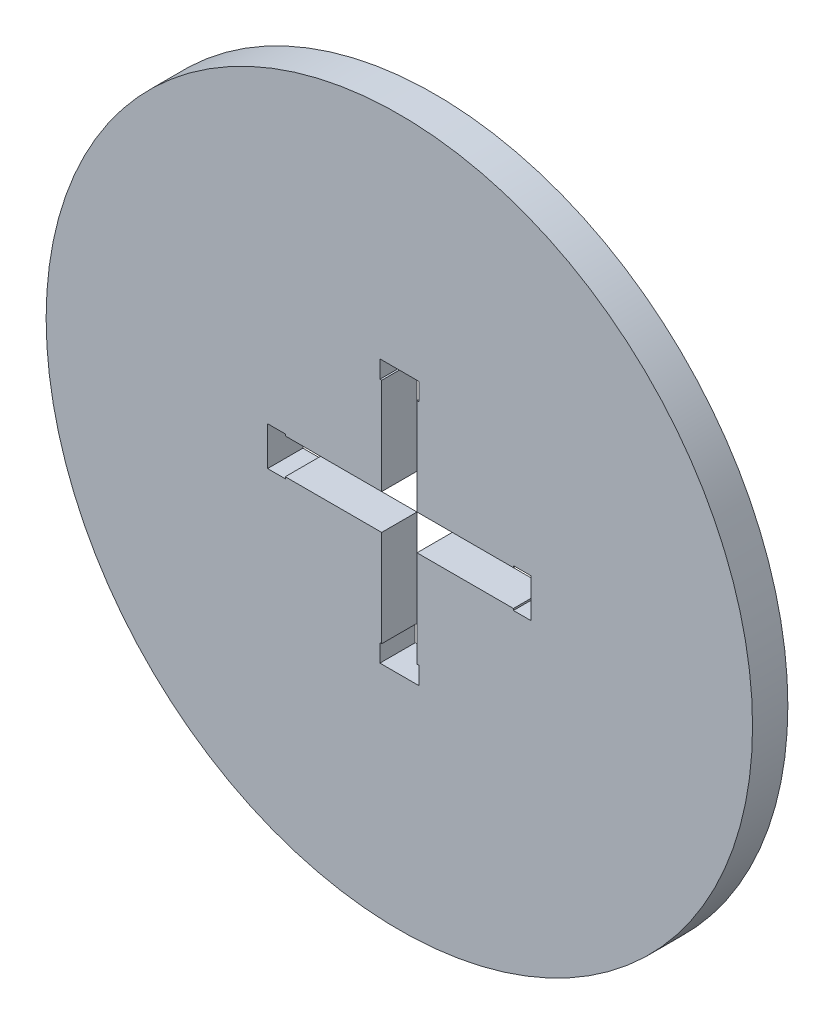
from build123d import *

# Parameters (mm, degrees)
CROQUIS2_R                  = 127
SALIENTE_EXTRUIR1_DEPTH     = 12.7
CORTAR_EXTRUIR1_DEPTH       = 181.05357536
CROQUIS4_W                  = 0.635
CROQUIS4_H                  = 6.35
CROQUIS4_W_2                = 6.35
CROQUIS4_H_2                = 0.635
CORTAR_EXTRUIR2_DEPTH       = 181.05357536
SIMETR_A2_COPY_1_SKETCH_W   = 0.635
SIMETR_A2_COPY_1_SKETCH_H   = 6.35
SIMETR_A2_COPY_1_SKETCH_W_2 = 6.35
SIMETR_A2_COPY_1_SKETCH_H_2 = 0.635
SIMETR_A2_COPY_1_DEPTH      = 181.05357536
SIMETR_A2_COPY_2_SKETCH_W   = 0.635
SIMETR_A2_COPY_2_SKETCH_H   = 6.35
SIMETR_A2_COPY_2_SKETCH_W_2 = 6.35
SIMETR_A2_COPY_2_SKETCH_H_2 = 0.635
SIMETR_A2_COPY_2_DEPTH      = 181.05357536


with BuildPart() as part:
    # Croquis2 → Saliente-Extruir1 (new body)
    with BuildSketch(Plane.XY):
        Circle(CROQUIS2_R)
    extrude(amount=SALIENTE_EXTRUIR1_DEPTH)

    # Croquis3 → Cortar-Extruir1 (cut, through all)
    with BuildSketch(Plane.XY.offset(12.7)):
        Polygon((6.35, 47.371), (-6.35, 47.371), (-6.35, 6.35), (-47.371, 6.35), (-47.371, -6.35), (-6.35, -6.35), (-6.35, -47.371), (6.35, -47.371), (6.35, -6.35), (47.371, -6.35), (47.371, 6.35), (6.35, 6.35), align=None)
    extrude(amount=-CORTAR_EXTRUIR1_DEPTH, mode=Mode.SUBTRACT)

    # Croquis4 → Cortar-Extruir2 (cut, through all)
    with BuildSketch(Plane.XY.offset(12.7)):
        with Locations((6.6675, 44.196)):
            Rectangle(CROQUIS4_W, CROQUIS4_H)
        with Locations((-6.6675, 44.196)):
            Rectangle(CROQUIS4_W, CROQUIS4_H)
        with Locations((-44.196, 6.6675)):
            Rectangle(CROQUIS4_W_2, CROQUIS4_H_2)
        with Locations((-44.196, -6.6675)):
            Rectangle(CROQUIS4_W_2, CROQUIS4_H_2)
    cortar_extruir2 = extrude(amount=-CORTAR_EXTRUIR2_DEPTH, mode=Mode.SUBTRACT)

    # Simetr_a1: Cortar-Extruir2 across plane
    add(cortar_extruir2.mirror(Plane.ZX), mode=Mode.SUBTRACT)

    # Simetr_a2 copy 1 sketch → Simetr_a2 copy 1 (cut, through all)
    with BuildSketch(Plane(origin=(0, 0, 12.7), x_dir=(-1, 0, 0), z_dir=(0, 0, 1))):
        with Locations((6.6675, 44.196)):
            Rectangle(SIMETR_A2_COPY_1_SKETCH_W, SIMETR_A2_COPY_1_SKETCH_H)
        with Locations((-6.6675, 44.196)):
            Rectangle(SIMETR_A2_COPY_1_SKETCH_W, SIMETR_A2_COPY_1_SKETCH_H)
        with Locations((-44.196, 6.6675)):
            Rectangle(SIMETR_A2_COPY_1_SKETCH_W_2, SIMETR_A2_COPY_1_SKETCH_H_2)
        with Locations((-44.196, -6.6675)):
            Rectangle(SIMETR_A2_COPY_1_SKETCH_W_2, SIMETR_A2_COPY_1_SKETCH_H_2)
    extrude(amount=-SIMETR_A2_COPY_1_DEPTH, mode=Mode.SUBTRACT)

    # Simetr_a2 copy 2 sketch → Simetr_a2 copy 2 (cut, through all)
    with BuildSketch(Plane(origin=(0, 0, 12.7), x_dir=(-1, 0, 0), z_dir=(0, 0, 1))):
        with Locations((6.6675, -44.196)):
            Rectangle(SIMETR_A2_COPY_2_SKETCH_W, SIMETR_A2_COPY_2_SKETCH_H)
        with Locations((-6.6675, -44.196)):
            Rectangle(SIMETR_A2_COPY_2_SKETCH_W, SIMETR_A2_COPY_2_SKETCH_H)
        with Locations((-44.196, -6.6675)):
            Rectangle(SIMETR_A2_COPY_2_SKETCH_W_2, SIMETR_A2_COPY_2_SKETCH_H_2)
        with Locations((-44.196, 6.6675)):
            Rectangle(SIMETR_A2_COPY_2_SKETCH_W_2, SIMETR_A2_COPY_2_SKETCH_H_2)
    extrude(amount=-SIMETR_A2_COPY_2_DEPTH, mode=Mode.SUBTRACT)


solid = part.part
